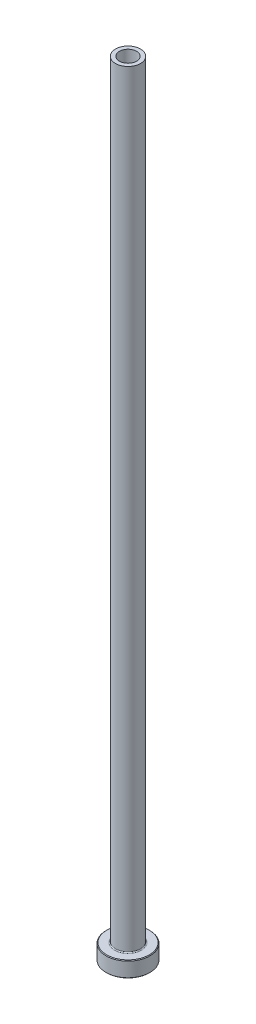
ISO-10303-21;
HEADER;
FILE_DESCRIPTION(('STEP AP214'),'2;1');
FILE_NAME('part.step','',(''),(''),'','','');
FILE_SCHEMA(('AUTOMOTIVE_DESIGN { 1 0 10303 214 1 1 1 1 }'));
ENDSEC;
DATA;
#1=APPLICATION_CONTEXT('core data for automotive mechanical design processes');
#2=APPLICATION_PROTOCOL_DEFINITION('international standard','automotive_design',2000,#1);
#3=PRODUCT_CONTEXT('',#1,'mechanical');
#4=PRODUCT('Part','Part','',(#3));
#5=PRODUCT_RELATED_PRODUCT_CATEGORY('part','',(#4));
#6=PRODUCT_DEFINITION_FORMATION('','',#4);
#7=PRODUCT_DEFINITION_CONTEXT('part definition',#1,'design');
#8=PRODUCT_DEFINITION('design','',#6,#7);
#9=PRODUCT_DEFINITION_SHAPE('','',#8);
#10=(LENGTH_UNIT() NAMED_UNIT(*) SI_UNIT(.MILLI.,.METRE.));
#11=(NAMED_UNIT(*) PLANE_ANGLE_UNIT() SI_UNIT($,.RADIAN.));
#12=(NAMED_UNIT(*) SI_UNIT($,.STERADIAN.) SOLID_ANGLE_UNIT());
#13=UNCERTAINTY_MEASURE_WITH_UNIT(LENGTH_MEASURE(1.E-05),#10,'distance_accuracy_value','');
#14=(GEOMETRIC_REPRESENTATION_CONTEXT(3) GLOBAL_UNCERTAINTY_ASSIGNED_CONTEXT((#13)) GLOBAL_UNIT_ASSIGNED_CONTEXT((#10,
#11,#12)) REPRESENTATION_CONTEXT('',''));
#15=CARTESIAN_POINT('',(0.,0.,0.));
#16=DIRECTION('',(0.,0.,1.));
#17=DIRECTION('',(1.,0.,0.));
#18=AXIS2_PLACEMENT_3D('',#15,#16,#17);
#19=CARTESIAN_POINT('',(0.,92.1876809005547,0.));
#20=DIRECTION('',(0.,1.,0.));
#21=DIRECTION('',(0.,0.,1.));
#22=AXIS2_PLACEMENT_3D('',#19,#20,#21);
#23=CYLINDRICAL_SURFACE('',#22,2.75000000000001);
#24=CARTESIAN_POINT('',(0.,250.,0.));
#25=DIRECTION('',(0.,1.,0.));
#26=DIRECTION('',(0.,0.,1.));
#27=AXIS2_PLACEMENT_3D('',#24,#25,#26);
#28=CIRCLE('',#27,2.75000000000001);
#29=CARTESIAN_POINT('',(0.,250.,2.75000000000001));
#30=VERTEX_POINT('',#29);
#31=EDGE_CURVE('E62',#30,#30,#28,.T.);
#32=ORIENTED_EDGE('',*,*,#31,.T.);
#33=EDGE_LOOP('',(#32));
#34=FACE_BOUND('',#33,.T.);
#35=CARTESIAN_POINT('',(0.,205.,0.));
#36=DIRECTION('',(0.,1.,0.));
#37=DIRECTION('',(0.,0.,1.));
#38=AXIS2_PLACEMENT_3D('',#35,#36,#37);
#39=CIRCLE('',#38,2.75000000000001);
#40=CARTESIAN_POINT('',(0.,205.,2.75000000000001));
#41=VERTEX_POINT('',#40);
#42=EDGE_CURVE('E71',#41,#41,#39,.T.);
#43=ORIENTED_EDGE('',*,*,#42,.F.);
#44=EDGE_LOOP('',(#43));
#45=FACE_BOUND('',#44,.T.);
#46=ADVANCED_FACE('F30',(#34,#45),#23,.F.);
#47=CARTESIAN_POINT('',(-2.75000000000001,250.,0.));
#48=DIRECTION('',(0.,1.,0.));
#49=DIRECTION('',(0.,0.,1.));
#50=AXIS2_PLACEMENT_3D('',#47,#48,#49);
#51=PLANE('',#50);
#52=CARTESIAN_POINT('',(0.,250.,0.));
#53=DIRECTION('',(0.,1.,0.));
#54=DIRECTION('',(0.,0.,1.));
#55=AXIS2_PLACEMENT_3D('',#52,#53,#54);
#56=CIRCLE('',#55,4.00000000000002);
#57=CARTESIAN_POINT('',(0.,250.,4.00000000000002));
#58=VERTEX_POINT('',#57);
#59=EDGE_CURVE('E65',#58,#58,#56,.T.);
#60=ORIENTED_EDGE('',*,*,#59,.T.);
#61=EDGE_LOOP('',(#60));
#62=FACE_BOUND('',#61,.T.);
#63=ORIENTED_EDGE('',*,*,#31,.F.);
#64=EDGE_LOOP('',(#63));
#65=FACE_BOUND('',#64,.T.);
#66=ADVANCED_FACE('F79',(#62,#65),#51,.T.);
#67=CARTESIAN_POINT('',(0.,92.1876809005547,0.));
#68=DIRECTION('',(0.,1.,0.));
#69=DIRECTION('',(0.,0.,1.));
#70=AXIS2_PLACEMENT_3D('',#67,#68,#69);
#71=CYLINDRICAL_SURFACE('',#70,4.);
#72=CARTESIAN_POINT('',(0.,5.3,0.));
#73=DIRECTION('',(0.,1.,0.));
#74=DIRECTION('',(0.,0.,1.));
#75=AXIS2_PLACEMENT_3D('',#72,#73,#74);
#76=CIRCLE('',#75,4.);
#77=CARTESIAN_POINT('',(0.,5.3,4.));
#78=VERTEX_POINT('',#77);
#79=EDGE_CURVE('E59',#78,#78,#76,.T.);
#80=ORIENTED_EDGE('',*,*,#79,.T.);
#81=EDGE_LOOP('',(#80));
#82=FACE_BOUND('',#81,.T.);
#83=ORIENTED_EDGE('',*,*,#59,.F.);
#84=EDGE_LOOP('',(#83));
#85=FACE_BOUND('',#84,.T.);
#86=ADVANCED_FACE('F85',(#82,#85),#71,.T.);
#87=CARTESIAN_POINT('',(-3.99999999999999,5.,0.));
#88=DIRECTION('',(0.,1.,0.));
#89=DIRECTION('',(0.,0.,1.));
#90=AXIS2_PLACEMENT_3D('',#87,#88,#89);
#91=PLANE('',#90);
#92=CARTESIAN_POINT('',(0.,5.,0.));
#93=DIRECTION('',(0.,1.,0.));
#94=DIRECTION('',(0.,0.,1.));
#95=AXIS2_PLACEMENT_3D('',#92,#93,#94);
#96=CIRCLE('',#95,6.79999999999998);
#97=CARTESIAN_POINT('',(0.,5.,6.79999999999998));
#98=VERTEX_POINT('',#97);
#99=EDGE_CURVE('E53',#98,#98,#96,.T.);
#100=ORIENTED_EDGE('',*,*,#99,.T.);
#101=EDGE_LOOP('',(#100));
#102=FACE_BOUND('',#101,.T.);
#103=CARTESIAN_POINT('',(0.,5.,0.));
#104=DIRECTION('',(0.,1.,0.));
#105=DIRECTION('',(0.,0.,1.));
#106=AXIS2_PLACEMENT_3D('',#103,#104,#105);
#107=CIRCLE('',#106,4.3);
#108=CARTESIAN_POINT('',(0.,5.,4.3));
#109=VERTEX_POINT('',#108);
#110=EDGE_CURVE('E56',#109,#109,#107,.F.);
#111=ORIENTED_EDGE('',*,*,#110,.T.);
#112=EDGE_LOOP('',(#111));
#113=FACE_BOUND('',#112,.T.);
#114=ADVANCED_FACE('F111',(#102,#113),#91,.T.);
#115=CARTESIAN_POINT('',(0.,92.1876809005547,0.));
#116=DIRECTION('',(0.,1.,0.));
#117=DIRECTION('',(0.,0.,1.));
#118=AXIS2_PLACEMENT_3D('',#115,#116,#117);
#119=CYLINDRICAL_SURFACE('',#118,6.99999999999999);
#120=CARTESIAN_POINT('',(0.,4.8,0.));
#121=DIRECTION('',(0.,1.,0.));
#122=DIRECTION('',(0.,0.,1.));
#123=AXIS2_PLACEMENT_3D('',#120,#121,#122);
#124=CIRCLE('',#123,6.99999999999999);
#125=CARTESIAN_POINT('',(0.,4.8,6.99999999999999));
#126=VERTEX_POINT('',#125);
#127=EDGE_CURVE('E45',#126,#126,#124,.F.);
#128=ORIENTED_EDGE('',*,*,#127,.T.);
#129=EDGE_LOOP('',(#128));
#130=FACE_BOUND('',#129,.T.);
#131=CARTESIAN_POINT('',(0.,0.199999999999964,0.));
#132=DIRECTION('',(0.,-1.,0.));
#133=DIRECTION('',(0.,0.,-1.));
#134=AXIS2_PLACEMENT_3D('',#131,#132,#133);
#135=CIRCLE('',#134,6.99999999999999);
#136=CARTESIAN_POINT('',(0.,0.199999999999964,-6.99999999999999));
#137=VERTEX_POINT('',#136);
#138=EDGE_CURVE('E50',#137,#137,#135,.F.);
#139=ORIENTED_EDGE('',*,*,#138,.T.);
#140=EDGE_LOOP('',(#139));
#141=FACE_BOUND('',#140,.T.);
#142=ADVANCED_FACE('F108',(#130,#141),#119,.T.);
#143=CARTESIAN_POINT('',(-6.99999999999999,0.,0.));
#144=DIRECTION('',(0.,-1.,0.));
#145=DIRECTION('',(0.,0.,-1.));
#146=AXIS2_PLACEMENT_3D('',#143,#144,#145);
#147=PLANE('',#146);
#148=CARTESIAN_POINT('',(0.,0.,0.));
#149=DIRECTION('',(0.,-1.,0.));
#150=DIRECTION('',(0.,0.,-1.));
#151=AXIS2_PLACEMENT_3D('',#148,#149,#150);
#152=CIRCLE('',#151,3.49999999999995);
#153=CARTESIAN_POINT('',(0.,0.,-3.49999999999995));
#154=VERTEX_POINT('',#153);
#155=EDGE_CURVE('E37',#154,#154,#152,.F.);
#156=ORIENTED_EDGE('',*,*,#155,.T.);
#157=EDGE_LOOP('',(#156));
#158=FACE_BOUND('',#157,.T.);
#159=CARTESIAN_POINT('',(0.,0.,0.));
#160=DIRECTION('',(0.,-1.,0.));
#161=DIRECTION('',(0.,0.,-1.));
#162=AXIS2_PLACEMENT_3D('',#159,#160,#161);
#163=CIRCLE('',#162,6.80000000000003);
#164=CARTESIAN_POINT('',(0.,0.,-6.80000000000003));
#165=VERTEX_POINT('',#164);
#166=EDGE_CURVE('E41',#165,#165,#163,.T.);
#167=ORIENTED_EDGE('',*,*,#166,.T.);
#168=EDGE_LOOP('',(#167));
#169=FACE_BOUND('',#168,.T.);
#170=ADVANCED_FACE('F110',(#158,#169),#147,.T.);
#171=CARTESIAN_POINT('',(0.,92.1876809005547,0.));
#172=DIRECTION('',(0.,1.,0.));
#173=DIRECTION('',(0.,0.,1.));
#174=AXIS2_PLACEMENT_3D('',#171,#172,#173);
#175=CYLINDRICAL_SURFACE('',#174,3.);
#176=CARTESIAN_POINT('',(0.,0.499999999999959,0.));
#177=DIRECTION('',(0.,-1.,0.));
#178=DIRECTION('',(0.,0.,-1.));
#179=AXIS2_PLACEMENT_3D('',#176,#177,#178);
#180=CIRCLE('',#179,3.);
#181=CARTESIAN_POINT('',(0.,0.499999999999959,-3.));
#182=VERTEX_POINT('',#181);
#183=EDGE_CURVE('E10',#182,#182,#180,.T.);
#184=ORIENTED_EDGE('',*,*,#183,.T.);
#185=EDGE_LOOP('',(#184));
#186=FACE_BOUND('',#185,.T.);
#187=CARTESIAN_POINT('',(0.,193.,0.));
#188=DIRECTION('',(0.,1.,0.));
#189=DIRECTION('',(0.,0.,1.));
#190=AXIS2_PLACEMENT_3D('',#187,#188,#189);
#191=CIRCLE('',#190,3.00000000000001);
#192=CARTESIAN_POINT('',(0.,193.,3.00000000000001));
#193=VERTEX_POINT('',#192);
#194=EDGE_CURVE('E68',#193,#193,#191,.T.);
#195=ORIENTED_EDGE('',*,*,#194,.T.);
#196=EDGE_LOOP('',(#195));
#197=FACE_BOUND('',#196,.T.);
#198=ADVANCED_FACE('F118',(#186,#197),#175,.F.);
#199=CARTESIAN_POINT('',(0.,193.,0.));
#200=DIRECTION('',(0.,-1.,0.));
#201=DIRECTION('',(0.,0.,-1.));
#202=AXIS2_PLACEMENT_3D('',#199,#200,#201);
#203=CONICAL_SURFACE('',#202,3.00000000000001,0.0208303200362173);
#204=ORIENTED_EDGE('',*,*,#42,.T.);
#205=EDGE_LOOP('',(#204));
#206=FACE_BOUND('',#205,.T.);
#207=ORIENTED_EDGE('',*,*,#194,.F.);
#208=EDGE_LOOP('',(#207));
#209=FACE_BOUND('',#208,.T.);
#210=ADVANCED_FACE('F75',(#206,#209),#203,.F.);
#211=CARTESIAN_POINT('',(0.,5.3,0.));
#212=DIRECTION('',(0.,1.,0.));
#213=DIRECTION('',(0.,0.,1.));
#214=AXIS2_PLACEMENT_3D('',#211,#212,#213);
#215=TOROIDAL_SURFACE('',#214,4.3,0.3);
#216=ORIENTED_EDGE('',*,*,#110,.F.);
#217=EDGE_LOOP('',(#216));
#218=FACE_BOUND('',#217,.T.);
#219=ORIENTED_EDGE('',*,*,#79,.F.);
#220=EDGE_LOOP('',(#219));
#221=FACE_BOUND('',#220,.T.);
#222=ADVANCED_FACE('F90',(#218,#221),#215,.F.);
#223=CARTESIAN_POINT('',(0.,5.,0.));
#224=DIRECTION('',(0.,-1.,0.));
#225=DIRECTION('',(0.,0.,-1.));
#226=AXIS2_PLACEMENT_3D('',#223,#224,#225);
#227=CONICAL_SURFACE('',#226,6.79999999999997,0.785398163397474);
#228=ORIENTED_EDGE('',*,*,#127,.F.);
#229=EDGE_LOOP('',(#228));
#230=FACE_BOUND('',#229,.T.);
#231=ORIENTED_EDGE('',*,*,#99,.F.);
#232=EDGE_LOOP('',(#231));
#233=FACE_BOUND('',#232,.T.);
#234=ADVANCED_FACE('F93',(#230,#233),#227,.T.);
#235=CARTESIAN_POINT('',(0.,0.199999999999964,0.));
#236=DIRECTION('',(0.,1.,0.));
#237=DIRECTION('',(0.,0.,1.));
#238=AXIS2_PLACEMENT_3D('',#235,#236,#237);
#239=CONICAL_SURFACE('',#238,6.99999999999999,0.78539816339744);
#240=ORIENTED_EDGE('',*,*,#166,.F.);
#241=EDGE_LOOP('',(#240));
#242=FACE_BOUND('',#241,.T.);
#243=ORIENTED_EDGE('',*,*,#138,.F.);
#244=EDGE_LOOP('',(#243));
#245=FACE_BOUND('',#244,.T.);
#246=ADVANCED_FACE('F96',(#242,#245),#239,.T.);
#247=CARTESIAN_POINT('',(0.,0.,0.));
#248=DIRECTION('',(0.,-1.,0.));
#249=DIRECTION('',(0.,0.,-1.));
#250=AXIS2_PLACEMENT_3D('',#247,#248,#249);
#251=CONICAL_SURFACE('',#250,3.49999999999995,0.785398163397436);
#252=ORIENTED_EDGE('',*,*,#183,.F.);
#253=EDGE_LOOP('',(#252));
#254=FACE_BOUND('',#253,.T.);
#255=ORIENTED_EDGE('',*,*,#155,.F.);
#256=EDGE_LOOP('',(#255));
#257=FACE_BOUND('',#256,.T.);
#258=ADVANCED_FACE('F32',(#254,#257),#251,.F.);
#259=CLOSED_SHELL('',(#46,#66,#86,#114,#142,#170,#198,#210,#222,#234,#246,#258));
#260=MANIFOLD_SOLID_BREP('B2',#259);
#261=ADVANCED_BREP_SHAPE_REPRESENTATION('',(#18,#260),#14);
#262=SHAPE_DEFINITION_REPRESENTATION(#9,#261);
ENDSEC;
END-ISO-10303-21;
